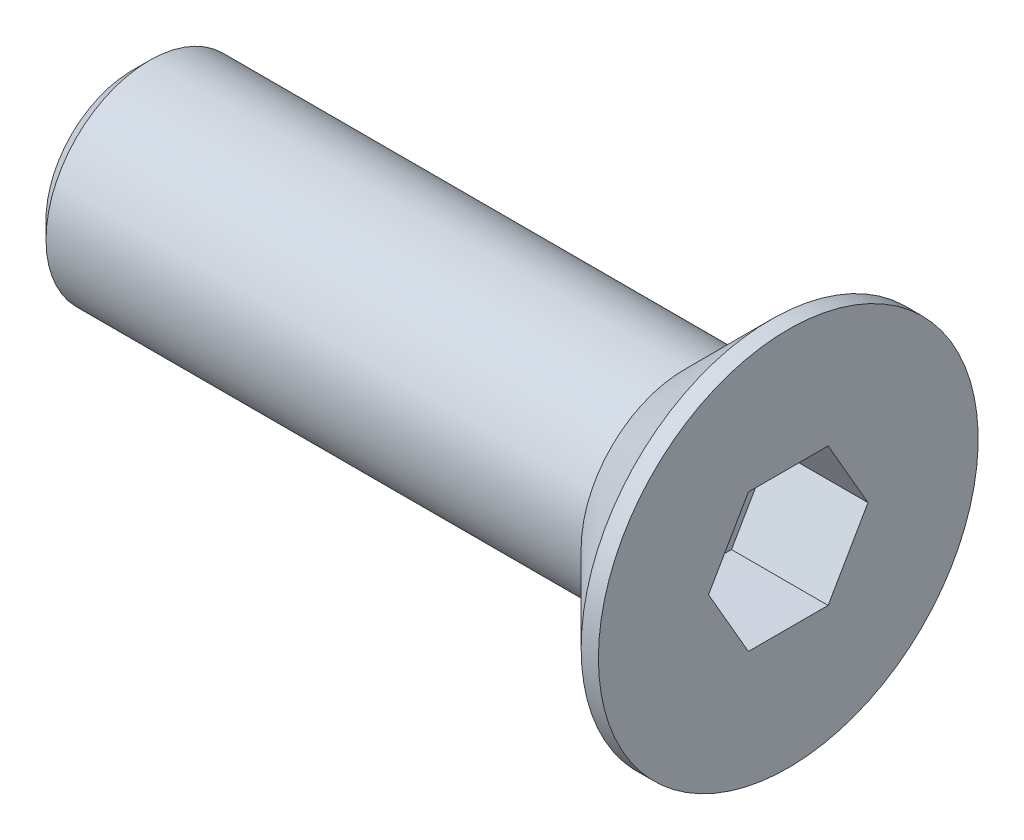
from build123d import *

# Parameters (mm, degrees)
CHANFREIN2_SIZE         = 0.5
EMPREINTE_POUR_CL_DEPTH = 2.8


with BuildPart() as part:
    # Esquisse1 → Base-R_volution (revolve)
    with BuildSketch(Plane.XY, mode=Mode.PRIVATE) as base_r_volution_sk:
        Polygon((0, 0), (0, 3), (16, 3), (18.5, 5.5), (19, 5.5), (19, 0), align=None)
    revolve(base_r_volution_sk.sketch.rotate(Axis((-25.828475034, 0, 0), (1, 0, 0)), 90), axis=Axis((-25.828475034, 0, 0), (1, 0, 0)))

    # Chanfrein2
    chanfrein2_edges = [part.edges().sort_by_distance(p)[0] for p in [
        (0, 0, -3),
    ]]
    chamfer(chanfrein2_edges, length=CHANFREIN2_SIZE)

    # Esquisse2 → Empreinte pour cl (cut)
    with BuildSketch(Plane(origin=(19, 0, 0), x_dir=(0, 0, -1), z_dir=(1, 0, 0))):
        Polygon((2.309401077, 0), (1.154700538, 2), (-1.154700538, 2), (-2.309401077, 0), (-1.154700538, -2), (1.154700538, -2), align=None)
    extrude(amount=-EMPREINTE_POUR_CL_DEPTH, mode=Mode.SUBTRACT)


solid = part.part
